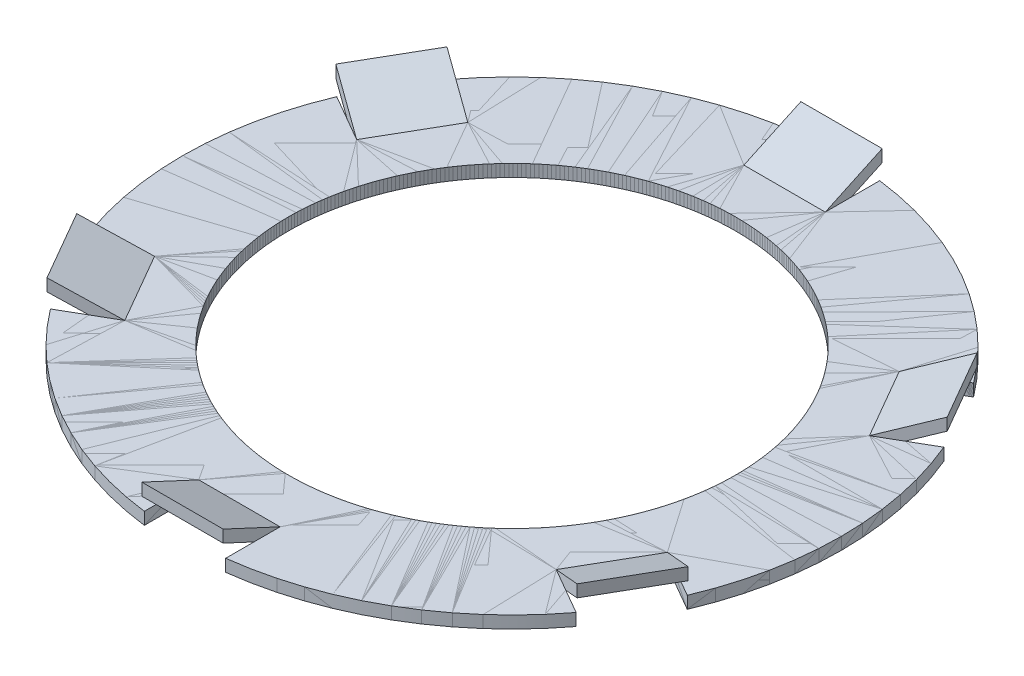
from build123d import *

# Parameters (mm, degrees)
ESQUISSE1_R                   = 40.5
ESQUISSE1_R_2                 = 27.5
EXTRUSION1_DEPTH              = 1.5
ESQUISSE2_W                   = 10
ESQUISSE2_H                   = 10.464803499
EXTRUSION2_DEPTH              = 7.5
R_P_TITION_CIRCULAIRE1_COUNT  = 6
R_P_TITION_CIRCULAIRE11_COUNT = 6


with BuildPart() as part:
    # Esquisse1 → Extrusion1 (new body)
    with BuildSketch(Plane(origin=(0, 0, 0), x_dir=(1, 0, 0), z_dir=(0, 1, 0))):
        with Locations(Location((0, 0, 0), (0, 0, 270))):
            Circle(ESQUISSE1_R)
        with Locations(Location((0, 0, 0), (0, 0, 270))):
            Circle(ESQUISSE1_R_2, mode=Mode.SUBTRACT)
    extrude(amount=EXTRUSION1_DEPTH)

    # Esquisse2 → Extrusion2 (cut)
    with BuildSketch(Plane(origin=(0, 1.5, 0), x_dir=(1, 0, 0), z_dir=(0, 1, 0))):
        with Locations((0, -38.732401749)):
            Rectangle(ESQUISSE2_W, ESQUISSE2_H)
    extrusion2 = extrude(amount=-EXTRUSION2_DEPTH, mode=Mode.SUBTRACT)

    # R_p_tition circulaire1: Extrusion2 ×6 about axis
    r_p_tition_circulaire1_axis = Axis((0, 0, 0), (0, 1, 0))
    for i in range(1, R_P_TITION_CIRCULAIRE1_COUNT):
        add(extrusion2.rotate(r_p_tition_circulaire1_axis, i * 360 / R_P_TITION_CIRCULAIRE1_COUNT), mode=Mode.SUBTRACT)

    # Esquisse3 → section 1 of lissage2
    with BuildSketch(Plane.XY.offset(40.5), mode=Mode.PRIVATE) as lissage2_s1:
        with BuildLine():
            Line((-5, 4.76), (5, 4.76))
            Line((5, 4.76), (5, 3.26))
            Line((5, 3.26), (-5, 3.26))
            Line((-5, 3.26), (-5, 4.76))
        make_face()
    # loft from a face of the part (lissage2)
    loft([part.faces().sort_by_distance((0, 0.75, 33.5))[0], lissage2_s1.sketch])


with BuildPart() as r_p_tition_circulaire11_1:
    # R_p_tition circulaire11: pattern copy
    add(part.part.rotate(Axis((0, 0, 0), (0, 1, 0)), 1 * 360 / R_P_TITION_CIRCULAIRE11_COUNT))


with BuildPart() as r_p_tition_circulaire11_2:
    # R_p_tition circulaire11: pattern copy
    add(part.part.rotate(Axis((0, 0, 0), (0, 1, 0)), 2 * 360 / R_P_TITION_CIRCULAIRE11_COUNT))


with BuildPart() as r_p_tition_circulaire11_3:
    # R_p_tition circulaire11: pattern copy
    add(part.part.rotate(Axis((0, 0, 0), (0, 1, 0)), 3 * 360 / R_P_TITION_CIRCULAIRE11_COUNT))


with BuildPart() as r_p_tition_circulaire11_4:
    # R_p_tition circulaire11: pattern copy
    add(part.part.rotate(Axis((0, 0, 0), (0, 1, 0)), 4 * 360 / R_P_TITION_CIRCULAIRE11_COUNT))


with BuildPart() as r_p_tition_circulaire11_5:
    # R_p_tition circulaire11: pattern copy
    add(part.part.rotate(Axis((0, 0, 0), (0, 1, 0)), 5 * 360 / R_P_TITION_CIRCULAIRE11_COUNT))


solid = Compound([part.part, r_p_tition_circulaire11_1.part, r_p_tition_circulaire11_2.part, r_p_tition_circulaire11_3.part, r_p_tition_circulaire11_4.part, r_p_tition_circulaire11_5.part])
